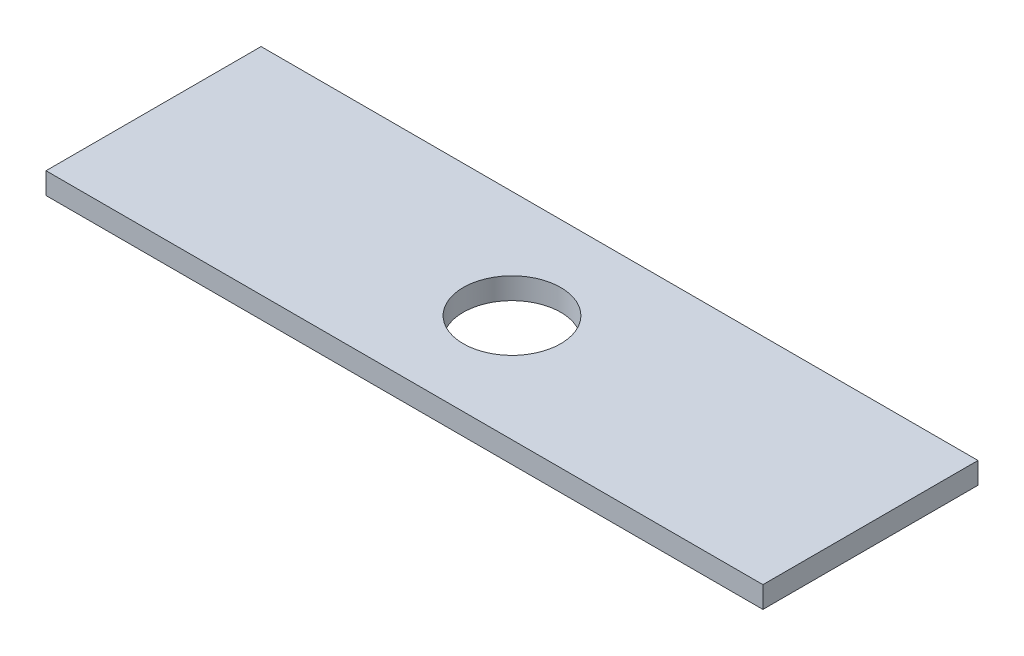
from build123d import *

# Parameters (mm, degrees)
ESQUISSE1_W      = 50
ESQUISSE1_H      = 15
ESQUISSE1_R      = 3.4
EXTRUSION1_DEPTH = 1.5


with BuildPart() as part:
    # Esquisse1 → Extrusion1 (new body)
    with BuildSketch(Plane(origin=(0, 0, 0), x_dir=(1, 0, 0), z_dir=(0, 1, 0))):
        Rectangle(ESQUISSE1_W, ESQUISSE1_H)
        with Locations(Location((0, 0, 0), (0, 0, 270))):
            Circle(ESQUISSE1_R, mode=Mode.SUBTRACT)
    extrude(amount=EXTRUSION1_DEPTH)


solid = part.part
